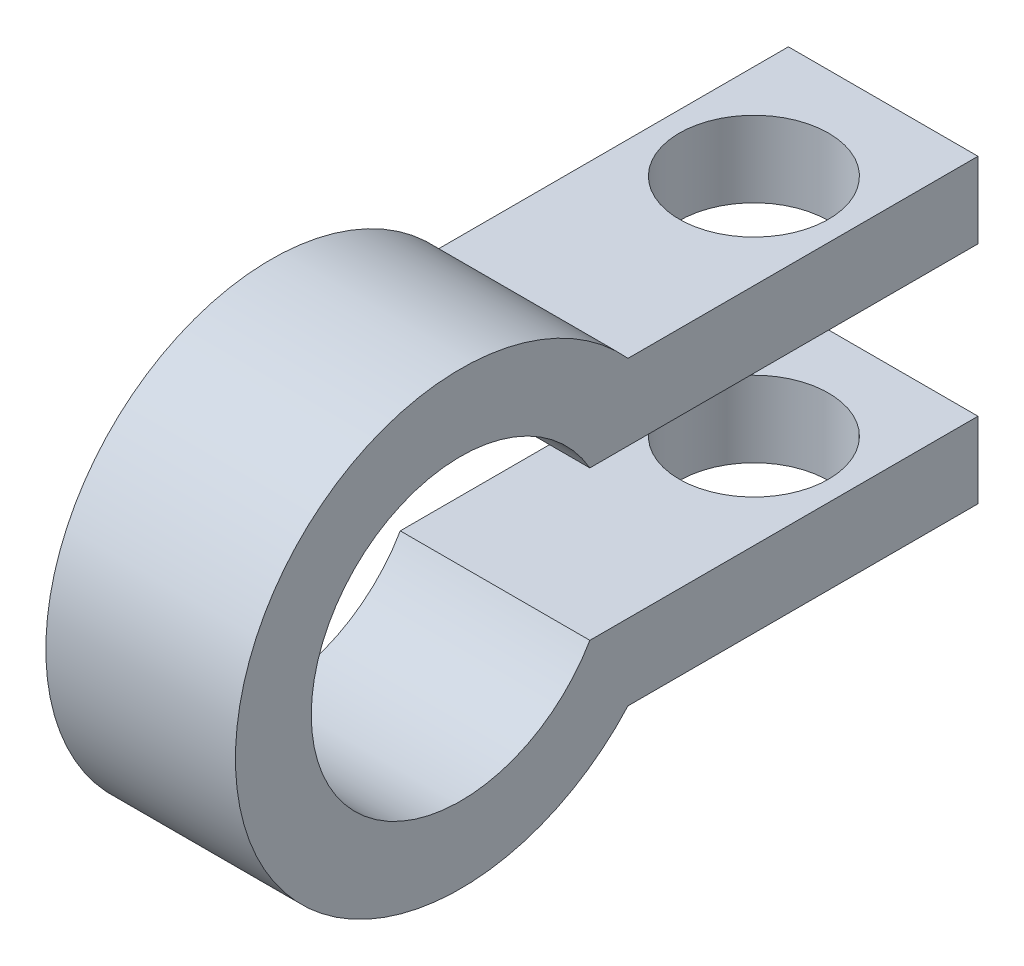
from build123d import *

# Parameters (mm, degrees)
LOOP_DEPTH            = 3.175
MOUNT_HOLE_DEPTH      = 20.164173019
MOUNT_HOLE_DEPTH_BACK = 20.164173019
SKETCH2_R             = 2.5


with BuildPart() as part:
    # Sketch1 → loop (new, symmetric)
    with BuildSketch(Plane(origin=(0, 0, 0), x_dir=(0, 0, -1), z_dir=(1, 0, 0))):
        with BuildLine():
            Line((17.330127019, -2.5), (4.330127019, -2.5))
            ThreePointArc((4.330127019, -2.5), (-5, 0), (4.330127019, 2.5))
            Line((4.330127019, 2.5), (17.330127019, 2.5))
            Line((17.330127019, 2.5), (17.330127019, 5.04))
            Line((17.330127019, 5.04), (5.608029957, 5.04))
            ThreePointArc((5.608029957, 5.04), (-7.54, 0), (5.608029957, -5.04))
            Line((5.608029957, -5.04), (17.330127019, -5.04))
            Line((17.330127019, -5.04), (17.330127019, -2.5))
        make_face()
    extrude(amount=LOOP_DEPTH, both=True)

    # Sketch2 → mount hole (cut, two sides: drawn at the far end of the back side and taken through both)
    with BuildSketch(Plane(origin=(0, 0, 0), x_dir=(1, 0, 0), z_dir=(0, 1, 0)).offset(-MOUNT_HOLE_DEPTH_BACK)):
        with Locations(Location((0, 13, 0), (0, 0, 90))):
            Circle(SKETCH2_R)
    extrude(amount=MOUNT_HOLE_DEPTH + MOUNT_HOLE_DEPTH_BACK, mode=Mode.SUBTRACT)


solid = part.part
